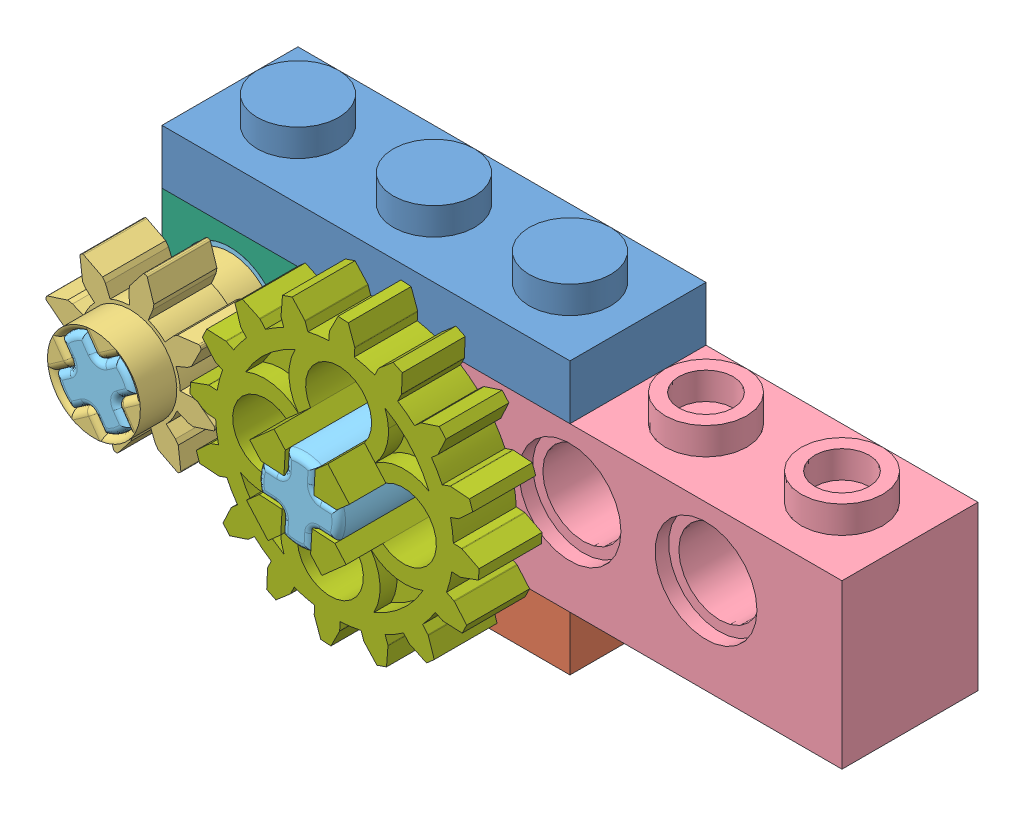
SolidWorks assembly Assem1.sldasm, configuration Default (file format 12000). Lengths in mm.
Overall size (43.01 17.99 16).
8 component instances, 7 part files, 20 mates.
Components (placement in the parent):
- 3626 Plate 1 x 3 Blue-1: 3626 Plate 1 x 3 Blue.SLDPRT [Default] at (0.1167 15.467 25.7904) size (24 4.8 8)
- 3626 Plate 1 x 3 Teal-1: 3626 Plate 1 x 3 Teal.SLDPRT [Default] at (0.1167 2.667 25.7904) size (24 4.8 8)
- 3647 Gear 8-1: 3647 Gear 8.SLDPRT [Default] at (-19.8833 11.467 33.7904) x (-0.819068 -0.573697 0) z (-0.573697 0.819068 0) size (10.06 8 10.06)
- 3701 Brick 1 x 4 with Holes Red-1: 3701 Brick 1 x 4 with Holes Red.SLDPRT [Default] at (0.1167 10.667 25.7904) size (32 11.2 8)
- 3749 Axle Pin without Friction Ridges Lengthwise-1: 3749 Axle Pin without Friction Ridges Lengthwise.SLDPRT [Default] at (-19.8833 11.467 29.7904) x (-0.819068 -0.573697 0) z (-0.573697 0.819068 0) size (6 16 6)
- 6541 Brick 1 x 1 with Hole Yellow-1: 6541 Brick 1 x 1 with Hole Yellow.SLDPRT [Default] at (-23.8833 5.867 29.7904) size (8 11.2 8)
- 4019 Gear 16 Tooth-1: 4019 Gear 16 Tooth.SLDPRT [Default] at (-7.8833 11.467 31.9404) x (-0.059879 -0.998206 0) z (-0.998206 0.059879 0) size (17 8 17)
- 3749 Axle Pin without Friction Ridges Lengthwise-2: 3749 Axle Pin without Friction Ridges Lengthwise.SLDPRT [Default] at (-7.8833 11.467 29.7904) x (0.998206 -0.059879 0) z (-0.059879 -0.998206 0) size (6 16 6)
Mates (geometry in assembly coordinates):
- Coincident1: coincident anti-aligned: plane of 3701 Brick 1 x 4 with Holes Red-1 through (-15.8833 15.467 21.7904) normal (-1 0 0); plane of 6541 Brick 1 x 1 with Hole Yellow-1 through (-15.8833 15.467 29.7904) normal (1 0 0)
- Coincident2: coincident aligned: plane of 3701 Brick 1 x 4 with Holes Red-1 through (0.1167 10.667 29.7904) normal (0 0 1); plane of 6541 Brick 1 x 1 with Hole Yellow-1 through (-23.8833 15.467 29.7904) normal (0 0 1)
- Coincident3: coincident aligned: plane of 3701 Brick 1 x 4 with Holes Red-1 through (-15.8833 15.467 21.7904) normal (0 1 0); plane of 6541 Brick 1 x 1 with Hole Yellow-1 through (-23.8833 15.467 29.7904) normal (0 1 0)
- Coincident4: coincident anti-aligned: plane of 3626 Plate 1 x 3 Blue-1 through (0.1167 15.467 25.7904) normal (0 -1 0); plane of 6541 Brick 1 x 1 with Hole Yellow-1 through (-23.8833 15.467 29.7904) normal (0 1 0)
- Coincident5: coincident aligned: plane of 3626 Plate 1 x 3 Blue-1 through (-23.8833 18.667 29.7904) normal (0 0 1); plane of 3701 Brick 1 x 4 with Holes Red-1 through (0.1167 10.667 29.7904) normal (0 0 1)
- Coincident6: coincident aligned: plane of 3626 Plate 1 x 3 Blue-1 through (-23.8833 18.667 29.7904) normal (-1 0 0); plane of 6541 Brick 1 x 1 with Hole Yellow-1 through (-23.8833 15.467 29.7904) normal (-1 0 0)
- Coincident7: coincident anti-aligned: plane of 3626 Plate 1 x 3 Teal-1 through (0.1167 5.867 25.7904) normal (0 1 0); plane of 3701 Brick 1 x 4 with Holes Red-1 through (-15.8833 5.867 21.7904) normal (0 -1 0)
- Coincident9: coincident aligned: plane of 3626 Plate 1 x 3 Teal-1 through (-23.8833 5.867 29.7904) normal (0 0 1); plane of 3701 Brick 1 x 4 with Holes Red-1 through (0.1167 10.667 29.7904) normal (0 0 1)
- Coincident10: coincident aligned: plane of 3626 Plate 1 x 3 Teal-1 through (-23.8833 5.867 29.7904) normal (-1 0 0); plane of 6541 Brick 1 x 1 with Hole Yellow-1 through (-23.8833 15.467 29.7904) normal (-1 0 0)
- Concentric1: concentric aligned: cylinder of 3749 Axle Pin without Friction Ridges Lengthwise-1 through (-19.8833 11.467 21.7904) axis (0 0 1) radius 2.4; cylinder of 6541 Brick 1 x 1 with Hole Yellow-1 through (-19.8833 11.467 17.9904) axis (0 0 1) radius 2.4
- Concentric2: concentric aligned: cylinder of 3701 Brick 1 x 4 with Holes Red-1 through (-7.8833 11.467 21.7904) axis (0 0 1) radius 2.4; cylinder of 3749 Axle Pin without Friction Ridges Lengthwise-2 through (-7.8833 11.467 21.7904) axis (0 0 1) radius 2.4
- Coincident11: coincident anti-aligned: plane of 3749 Axle Pin without Friction Ridges Lengthwise-1 through (-19.8833 11.467 28.9904) normal (0 0 -1); plane of 6541 Brick 1 x 1 with Hole Yellow-1 through (-19.8833 11.467 28.9904) normal (0 0 1)
- Coincident12: coincident anti-aligned: plane of 3701 Brick 1 x 4 with Holes Red-1 through (-7.8833 11.467 28.9904) normal (0 0 1); plane of 3749 Axle Pin without Friction Ridges Lengthwise-2 through (-7.8833 11.467 28.9904) normal (0 0 -1)
- Coincident13: coincident anti-aligned: plane of 3701 Brick 1 x 4 with Holes Red-1 through (0.1167 10.667 29.7904) normal (0 0 1); plane of 4019 Gear 16 Tooth-1 through (-7.8833 11.467 29.7904) normal (0 0 -1)
- Coincident14: coincident anti-aligned: plane of 4019 Gear 16 Tooth-1 through (-7.9767 9.0715 35.9404) normal (0.943792 0.330541 0); plane of 3749 Axle Pin without Friction Ridges Lengthwise-2 through (-8.2907 9.9681 37.7904) normal (-0.943792 -0.330541 0)
- Coincident15: coincident anti-aligned: plane of 4019 Gear 16 Tooth-1 through (-9.697 9.8994 35.9404) normal (-0.330541 0.943792 0); plane of 3749 Axle Pin without Friction Ridges Lengthwise-2 through (-9.6997 9.8984 37.7904) normal (0.330541 -0.943792 0)
- Concentric3: concentric anti-aligned: cylinder of 3647 Gear 8-1 through (-19.8833 11.467 29.7904) axis (0 0 1) radius 2.4; cylinder of 3749 Axle Pin without Friction Ridges Lengthwise-1 through (-19.8833 11.467 37.7904) axis (0 0 -1) radius 2.4
- Coincident16: coincident anti-aligned: plane of 3647 Gear 8-1 through (-21.935 10.2218 29.7904) normal (-0.169227 0.985577 0); plane of 3749 Axle Pin without Friction Ridges Lengthwise-1 through (-21.935 10.2218 37.7904) normal (0.169227 -0.985577 0)
- Coincident17: coincident anti-aligned: plane of 3647 Gear 8-1 through (-19.8833 11.467 29.7904) normal (0 0 -1); plane of 6541 Brick 1 x 1 with Hole Yellow-1 through (-23.8833 15.467 29.7904) normal (0 0 1)
- GearMate1: gear = 14 mm: circle of 3647 Gear 8-1; circle of 4019 Gear 16 Tooth-1
